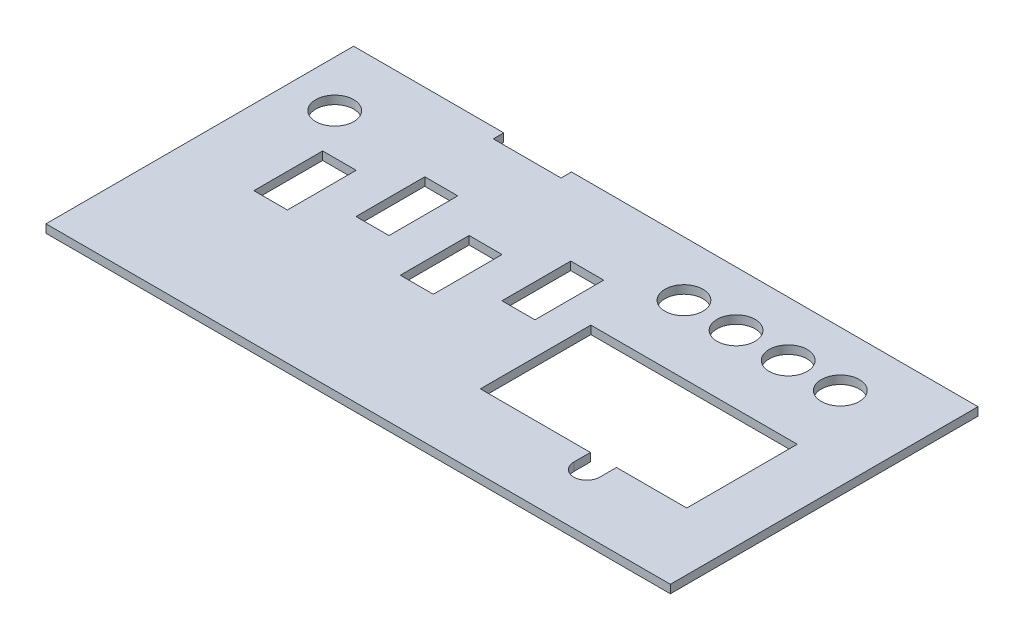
ISO-10303-21;
HEADER;
FILE_DESCRIPTION(('STEP AP214'),'2;1');
FILE_NAME('part.step','',(''),(''),'','','');
FILE_SCHEMA(('AUTOMOTIVE_DESIGN { 1 0 10303 214 1 1 1 1 }'));
ENDSEC;
DATA;
#1=APPLICATION_CONTEXT('core data for automotive mechanical design processes');
#2=APPLICATION_PROTOCOL_DEFINITION('international standard','automotive_design',2000,#1);
#3=PRODUCT_CONTEXT('',#1,'mechanical');
#4=PRODUCT('Part','Part','',(#3));
#5=PRODUCT_RELATED_PRODUCT_CATEGORY('part','',(#4));
#6=PRODUCT_DEFINITION_FORMATION('','',#4);
#7=PRODUCT_DEFINITION_CONTEXT('part definition',#1,'design');
#8=PRODUCT_DEFINITION('design','',#6,#7);
#9=PRODUCT_DEFINITION_SHAPE('','',#8);
#10=(LENGTH_UNIT() NAMED_UNIT(*) SI_UNIT(.MILLI.,.METRE.));
#11=(NAMED_UNIT(*) PLANE_ANGLE_UNIT() SI_UNIT($,.RADIAN.));
#12=(NAMED_UNIT(*) SI_UNIT($,.STERADIAN.) SOLID_ANGLE_UNIT());
#13=UNCERTAINTY_MEASURE_WITH_UNIT(LENGTH_MEASURE(1.E-05),#10,'distance_accuracy_value','');
#14=(GEOMETRIC_REPRESENTATION_CONTEXT(3) GLOBAL_UNCERTAINTY_ASSIGNED_CONTEXT((#13)) GLOBAL_UNIT_ASSIGNED_CONTEXT((#10,
#11,#12)) REPRESENTATION_CONTEXT('',''));
#15=CARTESIAN_POINT('',(0.,0.,0.));
#16=DIRECTION('',(0.,0.,1.));
#17=DIRECTION('',(1.,0.,0.));
#18=AXIS2_PLACEMENT_3D('',#15,#16,#17);
#19=CARTESIAN_POINT('',(48.8,0.,14.76));
#20=DIRECTION('',(0.,0.,1.));
#21=DIRECTION('',(1.,0.,0.));
#22=AXIS2_PLACEMENT_3D('',#19,#20,#21);
#23=PLANE('',#22);
#24=DIRECTION('',(1.,0.,0.));
#25=VECTOR('',#24,1.);
#26=CARTESIAN_POINT('',(48.8,0.,14.76));
#27=LINE('',#26,#25);
#28=CARTESIAN_POINT('',(35.32,0.,14.76));
#29=VERTEX_POINT('',#28);
#30=CARTESIAN_POINT('',(48.8,0.,14.76));
#31=VERTEX_POINT('',#30);
#32=EDGE_CURVE('E449',#29,#31,#27,.T.);
#33=ORIENTED_EDGE('',*,*,#32,.F.);
#34=DIRECTION('',(0.,-1.,0.));
#35=VECTOR('',#34,1.);
#36=CARTESIAN_POINT('',(35.32,1.5875,14.76));
#37=LINE('',#36,#35);
#38=CARTESIAN_POINT('',(35.32,1.5875,14.76));
#39=VERTEX_POINT('',#38);
#40=EDGE_CURVE('E277',#39,#29,#37,.T.);
#41=ORIENTED_EDGE('',*,*,#40,.F.);
#42=DIRECTION('',(1.,0.,0.));
#43=VECTOR('',#42,1.);
#44=CARTESIAN_POINT('',(48.8,1.5875,14.76));
#45=LINE('',#44,#43);
#46=CARTESIAN_POINT('',(48.8,1.5875,14.76));
#47=VERTEX_POINT('',#46);
#48=EDGE_CURVE('E269',#39,#47,#45,.T.);
#49=ORIENTED_EDGE('',*,*,#48,.T.);
#50=DIRECTION('',(0.,1.,0.));
#51=VECTOR('',#50,1.);
#52=CARTESIAN_POINT('',(48.8,0.,14.76));
#53=LINE('',#52,#51);
#54=EDGE_CURVE('E463',#31,#47,#53,.T.);
#55=ORIENTED_EDGE('',*,*,#54,.F.);
#56=EDGE_LOOP('',(#33,#41,#49,#55));
#57=FACE_BOUND('',#56,.T.);
#58=ADVANCED_FACE('F36',(#57),#23,.F.);
#59=CARTESIAN_POINT('',(0.,0.,0.));
#60=DIRECTION('',(0.,-1.,0.));
#61=DIRECTION('',(0.,0.,-1.));
#62=AXIS2_PLACEMENT_3D('',#59,#60,#61);
#63=PLANE('',#62);
#64=DIRECTION('',(0.,0.,1.));
#65=VECTOR('',#64,1.);
#66=CARTESIAN_POINT('',(35.32,0.,17.96));
#67=LINE('',#66,#65);
#68=CARTESIAN_POINT('',(35.32,0.,17.96));
#69=VERTEX_POINT('',#68);
#70=EDGE_CURVE('E251',#29,#69,#67,.T.);
#71=ORIENTED_EDGE('',*,*,#70,.F.);
#72=ORIENTED_EDGE('',*,*,#32,.T.);
#73=DIRECTION('',(0.,0.,-1.));
#74=VECTOR('',#73,1.);
#75=CARTESIAN_POINT('',(48.8,0.,14.76));
#76=LINE('',#75,#74);
#77=CARTESIAN_POINT('',(48.8,0.,-6.43999999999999));
#78=VERTEX_POINT('',#77);
#79=EDGE_CURVE('E439',#31,#78,#76,.T.);
#80=ORIENTED_EDGE('',*,*,#79,.T.);
#81=DIRECTION('',(-1.,0.,0.));
#82=VECTOR('',#81,1.);
#83=CARTESIAN_POINT('',(48.8,0.,-6.43999999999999));
#84=LINE('',#83,#82);
#85=CARTESIAN_POINT('',(9.19999999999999,0.,-6.43999999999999));
#86=VERTEX_POINT('',#85);
#87=EDGE_CURVE('E442',#78,#86,#84,.T.);
#88=ORIENTED_EDGE('',*,*,#87,.T.);
#89=DIRECTION('',(0.,0.,1.));
#90=VECTOR('',#89,1.);
#91=CARTESIAN_POINT('',(9.19999999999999,0.,-6.43999999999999));
#92=LINE('',#91,#90);
#93=CARTESIAN_POINT('',(9.19999999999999,0.,14.76));
#94=VERTEX_POINT('',#93);
#95=EDGE_CURVE('E446',#86,#94,#92,.T.);
#96=ORIENTED_EDGE('',*,*,#95,.T.);
#97=CARTESIAN_POINT('',(30.32,0.,14.76));
#98=VERTEX_POINT('',#97);
#99=EDGE_CURVE('E450',#94,#98,#27,.T.);
#100=ORIENTED_EDGE('',*,*,#99,.T.);
#101=DIRECTION('',(0.,0.,-1.));
#102=VECTOR('',#101,1.);
#103=CARTESIAN_POINT('',(30.32,0.,14.76));
#104=LINE('',#103,#102);
#105=CARTESIAN_POINT('',(30.32,0.,17.96));
#106=VERTEX_POINT('',#105);
#107=EDGE_CURVE('E51',#106,#98,#104,.T.);
#108=ORIENTED_EDGE('',*,*,#107,.F.);
#109=CARTESIAN_POINT('',(32.82,0.,17.96));
#110=DIRECTION('',(0.,-1.,0.));
#111=DIRECTION('',(0.,0.,-1.));
#112=AXIS2_PLACEMENT_3D('',#109,#110,#111);
#113=CIRCLE('',#112,2.5);
#114=EDGE_CURVE('E271',#69,#106,#113,.T.);
#115=ORIENTED_EDGE('',*,*,#114,.F.);
#116=EDGE_LOOP('',(#71,#72,#80,#88,#96,#100,#108,#115));
#117=FACE_BOUND('',#116,.T.);
#118=CARTESIAN_POINT('',(14.,0.,-19.5));
#119=DIRECTION('',(0.,1.,0.));
#120=DIRECTION('',(0.,0.,1.));
#121=AXIS2_PLACEMENT_3D('',#118,#119,#120);
#122=CIRCLE('',#121,3.65000000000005);
#123=CARTESIAN_POINT('',(14.,0.,-15.85));
#124=VERTEX_POINT('',#123);
#125=EDGE_CURVE('E353',#124,#124,#122,.T.);
#126=ORIENTED_EDGE('',*,*,#125,.T.);
#127=EDGE_LOOP('',(#126));
#128=FACE_BOUND('',#127,.T.);
#129=CARTESIAN_POINT('',(34.,0.,-19.5));
#130=DIRECTION('',(0.,1.,0.));
#131=DIRECTION('',(0.,0.,1.));
#132=AXIS2_PLACEMENT_3D('',#129,#130,#131);
#133=CIRCLE('',#132,3.65000000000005);
#134=CARTESIAN_POINT('',(34.,0.,-15.85));
#135=VERTEX_POINT('',#134);
#136=EDGE_CURVE('E360',#135,#135,#133,.T.);
#137=ORIENTED_EDGE('',*,*,#136,.T.);
#138=EDGE_LOOP('',(#137));
#139=FACE_BOUND('',#138,.T.);
#140=CARTESIAN_POINT('',(44.,0.,-19.5));
#141=DIRECTION('',(0.,1.,0.));
#142=DIRECTION('',(0.,0.,1.));
#143=AXIS2_PLACEMENT_3D('',#140,#141,#142);
#144=CIRCLE('',#143,3.65000000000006);
#145=CARTESIAN_POINT('',(44.,0.,-15.8499999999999));
#146=VERTEX_POINT('',#145);
#147=EDGE_CURVE('E366',#146,#146,#144,.T.);
#148=ORIENTED_EDGE('',*,*,#147,.T.);
#149=EDGE_LOOP('',(#148));
#150=FACE_BOUND('',#149,.T.);
#151=CARTESIAN_POINT('',(-51.,0.,-17.5000000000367));
#152=DIRECTION('',(0.,1.,0.));
#153=DIRECTION('',(0.,0.,1.));
#154=AXIS2_PLACEMENT_3D('',#151,#152,#153);
#155=CIRCLE('',#154,3.65000000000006);
#156=CARTESIAN_POINT('',(-51.,0.,-13.8500000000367));
#157=VERTEX_POINT('',#156);
#158=EDGE_CURVE('E372',#157,#157,#155,.T.);
#159=ORIENTED_EDGE('',*,*,#158,.T.);
#160=EDGE_LOOP('',(#159));
#161=FACE_BOUND('',#160,.T.);
#162=DIRECTION('',(-1.,0.,0.));
#163=VECTOR('',#162,1.);
#164=CARTESIAN_POINT('',(2.96550000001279,0.,-15.1431105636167));
#165=LINE('',#164,#163);
#166=CARTESIAN_POINT('',(2.96550000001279,0.,-15.1431105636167));
#167=VERTEX_POINT('',#166);
#168=CARTESIAN_POINT('',(-3.36550000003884,0.,-15.1431105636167));
#169=VERTEX_POINT('',#168);
#170=EDGE_CURVE('E379',#167,#169,#165,.T.);
#171=ORIENTED_EDGE('',*,*,#170,.T.);
#172=DIRECTION('',(2.82327588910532E-12,0.,1.));
#173=VECTOR('',#172,1.);
#174=CARTESIAN_POINT('',(-3.36550000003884,0.,-15.1431105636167));
#175=LINE('',#174,#173);
#176=CARTESIAN_POINT('',(-3.36550000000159,0.,-1.94655276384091));
#177=VERTEX_POINT('',#176);
#178=EDGE_CURVE('E382',#169,#177,#175,.T.);
#179=ORIENTED_EDGE('',*,*,#178,.T.);
#180=DIRECTION('',(1.,0.,0.));
#181=VECTOR('',#180,1.);
#182=CARTESIAN_POINT('',(-3.36550000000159,0.,-1.94655276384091));
#183=LINE('',#182,#181);
#184=CARTESIAN_POINT('',(2.96550000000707,0.,-1.94655276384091));
#185=VERTEX_POINT('',#184);
#186=EDGE_CURVE('E59',#177,#185,#183,.T.);
#187=ORIENTED_EDGE('',*,*,#186,.T.);
#188=DIRECTION('',(4.33301042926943E-13,0.,-1.));
#189=VECTOR('',#188,1.);
#190=CARTESIAN_POINT('',(2.96550000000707,0.,-1.94655276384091));
#191=LINE('',#190,#189);
#192=EDGE_CURVE('E387',#185,#167,#191,.T.);
#193=ORIENTED_EDGE('',*,*,#192,.T.);
#194=EDGE_LOOP('',(#171,#179,#187,#193));
#195=FACE_BOUND('',#194,.T.);
#196=DIRECTION('',(-1.,0.,0.));
#197=VECTOR('',#196,1.);
#198=CARTESIAN_POINT('',(-11.0344999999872,0.,-9.64311056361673));
#199=LINE('',#198,#197);
#200=CARTESIAN_POINT('',(-11.0344999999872,0.,-9.64311056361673));
#201=VERTEX_POINT('',#200);
#202=CARTESIAN_POINT('',(-17.3655000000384,0.,-9.64311056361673));
#203=VERTEX_POINT('',#202);
#204=EDGE_CURVE('E409',#201,#203,#199,.T.);
#205=ORIENTED_EDGE('',*,*,#204,.T.);
#206=DIRECTION('',(3.37465434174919E-12,0.,1.));
#207=VECTOR('',#206,1.);
#208=CARTESIAN_POINT('',(-17.3655000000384,0.,-9.64311056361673));
#209=LINE('',#208,#207);
#210=CARTESIAN_POINT('',(-17.3654999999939,0.,3.55344723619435));
#211=VERTEX_POINT('',#210);
#212=EDGE_CURVE('E412',#203,#211,#209,.T.);
#213=ORIENTED_EDGE('',*,*,#212,.T.);
#214=DIRECTION('',(1.,0.,-5.01524421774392E-12));
#215=VECTOR('',#214,1.);
#216=CARTESIAN_POINT('',(-17.3654999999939,0.,3.55344723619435));
#217=LINE('',#216,#215);
#218=CARTESIAN_POINT('',(-11.0344999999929,0.,3.5534472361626));
#219=VERTEX_POINT('',#218);
#220=EDGE_CURVE('E416',#211,#219,#217,.T.);
#221=ORIENTED_EDGE('',*,*,#220,.T.);
#222=DIRECTION('',(4.33399632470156E-13,0.,-1.));
#223=VECTOR('',#222,1.);
#224=CARTESIAN_POINT('',(-11.0344999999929,0.,3.5534472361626));
#225=LINE('',#224,#223);
#226=EDGE_CURVE('E419',#219,#201,#225,.T.);
#227=ORIENTED_EDGE('',*,*,#226,.T.);
#228=EDGE_LOOP('',(#205,#213,#221,#227));
#229=FACE_BOUND('',#228,.T.);
#230=DIRECTION('',(2.82255289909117E-12,0.,1.));
#231=VECTOR('',#230,1.);
#232=CARTESIAN_POINT('',(-31.3655000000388,0.,-15.1431105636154));
#233=LINE('',#232,#231);
#234=CARTESIAN_POINT('',(-31.3655000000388,0.,-15.1431105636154));
#235=VERTEX_POINT('',#234);
#236=CARTESIAN_POINT('',(-31.3655000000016,0.,-1.94655276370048));
#237=VERTEX_POINT('',#236);
#238=EDGE_CURVE('E283',#235,#237,#233,.T.);
#239=ORIENTED_EDGE('',*,*,#238,.T.);
#240=DIRECTION('',(1.,0.,0.));
#241=VECTOR('',#240,1.);
#242=CARTESIAN_POINT('',(-31.3655000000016,0.,-1.94655276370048));
#243=LINE('',#242,#241);
#244=CARTESIAN_POINT('',(-25.0344999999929,0.,-1.94655276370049));
#245=VERTEX_POINT('',#244);
#246=EDGE_CURVE('E286',#237,#245,#243,.T.);
#247=ORIENTED_EDGE('',*,*,#246,.T.);
#248=DIRECTION('',(4.33268179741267E-13,0.,-1.));
#249=VECTOR('',#248,1.);
#250=CARTESIAN_POINT('',(-25.0344999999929,0.,-1.94655276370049));
#251=LINE('',#250,#249);
#252=CARTESIAN_POINT('',(-25.0344999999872,0.,-15.1431105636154));
#253=VERTEX_POINT('',#252);
#254=EDGE_CURVE('E290',#245,#253,#251,.T.);
#255=ORIENTED_EDGE('',*,*,#254,.T.);
#256=DIRECTION('',(-1.,0.,0.));
#257=VECTOR('',#256,1.);
#258=CARTESIAN_POINT('',(-25.0344999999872,0.,-15.1431105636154));
#259=LINE('',#258,#257);
#260=EDGE_CURVE('E293',#253,#235,#259,.T.);
#261=ORIENTED_EDGE('',*,*,#260,.T.);
#262=EDGE_LOOP('',(#239,#247,#255,#261));
#263=FACE_BOUND('',#262,.T.);
#264=DIRECTION('',(0.,0.,1.));
#265=VECTOR('',#264,1.);
#266=CARTESIAN_POINT('',(-45.46,0.,-9.64311056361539));
#267=LINE('',#266,#265);
#268=CARTESIAN_POINT('',(-45.46,0.,-9.64311056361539));
#269=VERTEX_POINT('',#268);
#270=CARTESIAN_POINT('',(-45.46,0.,3.55344723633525));
#271=VERTEX_POINT('',#270);
#272=EDGE_CURVE('E317',#269,#271,#267,.T.);
#273=ORIENTED_EDGE('',*,*,#272,.T.);
#274=DIRECTION('',(1.,0.,-5.01505303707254E-12));
#275=VECTOR('',#274,1.);
#276=CARTESIAN_POINT('',(-45.46,0.,3.55344723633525));
#277=LINE('',#276,#275);
#278=CARTESIAN_POINT('',(-39.0344999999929,0.,3.55344723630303));
#279=VERTEX_POINT('',#278);
#280=EDGE_CURVE('E320',#271,#279,#277,.T.);
#281=ORIENTED_EDGE('',*,*,#280,.T.);
#282=DIRECTION('',(4.33268179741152E-13,0.,-1.));
#283=VECTOR('',#282,1.);
#284=CARTESIAN_POINT('',(-39.0344999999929,0.,3.55344723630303));
#285=LINE('',#284,#283);
#286=CARTESIAN_POINT('',(-39.0344999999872,0.,-9.64311056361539));
#287=VERTEX_POINT('',#286);
#288=EDGE_CURVE('E324',#279,#287,#285,.T.);
#289=ORIENTED_EDGE('',*,*,#288,.T.);
#290=DIRECTION('',(-1.,0.,0.));
#291=VECTOR('',#290,1.);
#292=CARTESIAN_POINT('',(-39.0344999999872,0.,-9.64311056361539));
#293=LINE('',#292,#291);
#294=EDGE_CURVE('E327',#287,#269,#293,.T.);
#295=ORIENTED_EDGE('',*,*,#294,.T.);
#296=EDGE_LOOP('',(#273,#281,#289,#295));
#297=FACE_BOUND('',#296,.T.);
#298=CARTESIAN_POINT('',(24.,0.,-19.5));
#299=DIRECTION('',(0.,1.,0.));
#300=DIRECTION('',(0.,0.,1.));
#301=AXIS2_PLACEMENT_3D('',#298,#299,#300);
#302=CIRCLE('',#301,3.65000000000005);
#303=CARTESIAN_POINT('',(24.,0.,-15.8499999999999));
#304=VERTEX_POINT('',#303);
#305=EDGE_CURVE('E334',#304,#304,#302,.T.);
#306=ORIENTED_EDGE('',*,*,#305,.T.);
#307=EDGE_LOOP('',(#306));
#308=FACE_BOUND('',#307,.T.);
#309=DIRECTION('',(0.,0.,1.));
#310=VECTOR('',#309,1.);
#311=CARTESIAN_POINT('',(-31.1,0.,-30.02));
#312=LINE('',#311,#310);
#313=CARTESIAN_POINT('',(-31.1,0.,-30.02));
#314=VERTEX_POINT('',#313);
#315=CARTESIAN_POINT('',(-31.1,0.,-28.02));
#316=VERTEX_POINT('',#315);
#317=EDGE_CURVE('E493',#314,#316,#312,.T.);
#318=ORIENTED_EDGE('',*,*,#317,.T.);
#319=DIRECTION('',(1.,0.,0.));
#320=VECTOR('',#319,1.);
#321=CARTESIAN_POINT('',(-31.1,0.,-28.02));
#322=LINE('',#321,#320);
#323=CARTESIAN_POINT('',(-18.1,0.,-28.02));
#324=VERTEX_POINT('',#323);
#325=EDGE_CURVE('E466',#316,#324,#322,.T.);
#326=ORIENTED_EDGE('',*,*,#325,.T.);
#327=DIRECTION('',(0.,0.,-1.));
#328=VECTOR('',#327,1.);
#329=CARTESIAN_POINT('',(-18.1,0.,-28.02));
#330=LINE('',#329,#328);
#331=CARTESIAN_POINT('',(-18.1,0.,-30.02));
#332=VERTEX_POINT('',#331);
#333=EDGE_CURVE('E475',#324,#332,#330,.T.);
#334=ORIENTED_EDGE('',*,*,#333,.T.);
#335=DIRECTION('',(1.,0.,0.));
#336=VECTOR('',#335,1.);
#337=CARTESIAN_POINT('',(-18.1,0.,-30.02));
#338=LINE('',#337,#336);
#339=CARTESIAN_POINT('',(59.895,0.,-30.02));
#340=VERTEX_POINT('',#339);
#341=EDGE_CURVE('E478',#332,#340,#338,.T.);
#342=ORIENTED_EDGE('',*,*,#341,.T.);
#343=DIRECTION('',(0.,0.,1.));
#344=VECTOR('',#343,1.);
#345=CARTESIAN_POINT('',(59.895,0.,-30.02));
#346=LINE('',#345,#344);
#347=CARTESIAN_POINT('',(59.895,0.,29.));
#348=VERTEX_POINT('',#347);
#349=EDGE_CURVE('E481',#340,#348,#346,.T.);
#350=ORIENTED_EDGE('',*,*,#349,.T.);
#351=DIRECTION('',(-1.,0.,0.));
#352=VECTOR('',#351,1.);
#353=CARTESIAN_POINT('',(59.895,0.,29.));
#354=LINE('',#353,#352);
#355=CARTESIAN_POINT('',(-59.895,0.,29.));
#356=VERTEX_POINT('',#355);
#357=EDGE_CURVE('E484',#348,#356,#354,.T.);
#358=ORIENTED_EDGE('',*,*,#357,.T.);
#359=DIRECTION('',(0.,0.,-1.));
#360=VECTOR('',#359,1.);
#361=CARTESIAN_POINT('',(-59.895,0.,29.));
#362=LINE('',#361,#360);
#363=CARTESIAN_POINT('',(-59.895,0.,-30.02));
#364=VERTEX_POINT('',#363);
#365=EDGE_CURVE('E487',#356,#364,#362,.T.);
#366=ORIENTED_EDGE('',*,*,#365,.T.);
#367=DIRECTION('',(1.,0.,0.));
#368=VECTOR('',#367,1.);
#369=CARTESIAN_POINT('',(-59.895,0.,-30.02));
#370=LINE('',#369,#368);
#371=EDGE_CURVE('E490',#364,#314,#370,.T.);
#372=ORIENTED_EDGE('',*,*,#371,.T.);
#373=EDGE_LOOP('',(#318,#326,#334,#342,#350,#358,#366,#372));
#374=FACE_BOUND('',#373,.T.);
#375=ADVANCED_FACE('F38',(#117,#128,#139,#150,#161,#195,#229,#263,#297,#308,#374),#63,.T.);
#376=CARTESIAN_POINT('',(-31.1,10.,-28.02));
#377=DIRECTION('',(0.,0.,-1.));
#378=DIRECTION('',(-1.,0.,0.));
#379=AXIS2_PLACEMENT_3D('',#376,#377,#378);
#380=PLANE('',#379);
#381=DIRECTION('',(1.,0.,0.));
#382=VECTOR('',#381,1.);
#383=CARTESIAN_POINT('',(0.,1.5875,-28.02));
#384=LINE('',#383,#382);
#385=CARTESIAN_POINT('',(-31.1,1.5875,-28.02));
#386=VERTEX_POINT('',#385);
#387=CARTESIAN_POINT('',(-18.1,1.5875,-28.02));
#388=VERTEX_POINT('',#387);
#389=EDGE_CURVE('E12',#386,#388,#384,.T.);
#390=ORIENTED_EDGE('',*,*,#389,.T.);
#391=DIRECTION('',(0.,-1.,0.));
#392=VECTOR('',#391,1.);
#393=CARTESIAN_POINT('',(-18.1,10.,-28.02));
#394=LINE('',#393,#392);
#395=EDGE_CURVE('E496',#388,#324,#394,.T.);
#396=ORIENTED_EDGE('',*,*,#395,.T.);
#397=ORIENTED_EDGE('',*,*,#325,.F.);
#398=DIRECTION('',(0.,-1.,0.));
#399=VECTOR('',#398,1.);
#400=CARTESIAN_POINT('',(-31.1,10.,-28.02));
#401=LINE('',#400,#399);
#402=EDGE_CURVE('E497',#386,#316,#401,.T.);
#403=ORIENTED_EDGE('',*,*,#402,.F.);
#404=EDGE_LOOP('',(#390,#396,#397,#403));
#405=FACE_BOUND('',#404,.T.);
#406=ADVANCED_FACE('F535',(#405),#380,.T.);
#407=CARTESIAN_POINT('',(-31.1,10.,-30.02));
#408=DIRECTION('',(1.,0.,0.));
#409=DIRECTION('',(0.,0.,-1.));
#410=AXIS2_PLACEMENT_3D('',#407,#408,#409);
#411=PLANE('',#410);
#412=DIRECTION('',(0.,0.,1.));
#413=VECTOR('',#412,1.);
#414=CARTESIAN_POINT('',(-31.1,1.5875,0.));
#415=LINE('',#414,#413);
#416=CARTESIAN_POINT('',(-31.1,1.5875,-30.02));
#417=VERTEX_POINT('',#416);
#418=EDGE_CURVE('E44',#417,#386,#415,.T.);
#419=ORIENTED_EDGE('',*,*,#418,.T.);
#420=ORIENTED_EDGE('',*,*,#402,.T.);
#421=ORIENTED_EDGE('',*,*,#317,.F.);
#422=DIRECTION('',(0.,-1.,0.));
#423=VECTOR('',#422,1.);
#424=CARTESIAN_POINT('',(-31.1,10.,-30.02));
#425=LINE('',#424,#423);
#426=EDGE_CURVE('E500',#417,#314,#425,.T.);
#427=ORIENTED_EDGE('',*,*,#426,.F.);
#428=EDGE_LOOP('',(#419,#420,#421,#427));
#429=FACE_BOUND('',#428,.T.);
#430=ADVANCED_FACE('F528',(#429),#411,.T.);
#431=CARTESIAN_POINT('',(-59.895,10.,-30.02));
#432=DIRECTION('',(0.,0.,-1.));
#433=DIRECTION('',(-1.,0.,0.));
#434=AXIS2_PLACEMENT_3D('',#431,#432,#433);
#435=PLANE('',#434);
#436=DIRECTION('',(1.,0.,0.));
#437=VECTOR('',#436,1.);
#438=CARTESIAN_POINT('',(0.,1.5875,-30.02));
#439=LINE('',#438,#437);
#440=CARTESIAN_POINT('',(-59.895,1.5875,-30.02));
#441=VERTEX_POINT('',#440);
#442=EDGE_CURVE('E523',#441,#417,#439,.T.);
#443=ORIENTED_EDGE('',*,*,#442,.T.);
#444=ORIENTED_EDGE('',*,*,#426,.T.);
#445=ORIENTED_EDGE('',*,*,#371,.F.);
#446=DIRECTION('',(0.,-1.,0.));
#447=VECTOR('',#446,1.);
#448=CARTESIAN_POINT('',(-59.895,10.,-30.02));
#449=LINE('',#448,#447);
#450=EDGE_CURVE('E502',#441,#364,#449,.T.);
#451=ORIENTED_EDGE('',*,*,#450,.F.);
#452=EDGE_LOOP('',(#443,#444,#445,#451));
#453=FACE_BOUND('',#452,.T.);
#454=ADVANCED_FACE('F552',(#453),#435,.T.);
#455=CARTESIAN_POINT('',(-59.895,10.,29.));
#456=DIRECTION('',(-1.,0.,0.));
#457=DIRECTION('',(0.,0.,1.));
#458=AXIS2_PLACEMENT_3D('',#455,#456,#457);
#459=PLANE('',#458);
#460=DIRECTION('',(0.,0.,-1.));
#461=VECTOR('',#460,1.);
#462=CARTESIAN_POINT('',(-59.895,1.5875,0.));
#463=LINE('',#462,#461);
#464=CARTESIAN_POINT('',(-59.895,1.5875,29.));
#465=VERTEX_POINT('',#464);
#466=EDGE_CURVE('E521',#465,#441,#463,.T.);
#467=ORIENTED_EDGE('',*,*,#466,.T.);
#468=ORIENTED_EDGE('',*,*,#450,.T.);
#469=ORIENTED_EDGE('',*,*,#365,.F.);
#470=DIRECTION('',(0.,-1.,0.));
#471=VECTOR('',#470,1.);
#472=CARTESIAN_POINT('',(-59.895,10.,29.));
#473=LINE('',#472,#471);
#474=EDGE_CURVE('E504',#465,#356,#473,.T.);
#475=ORIENTED_EDGE('',*,*,#474,.F.);
#476=EDGE_LOOP('',(#467,#468,#469,#475));
#477=FACE_BOUND('',#476,.T.);
#478=ADVANCED_FACE('F557',(#477),#459,.T.);
#479=CARTESIAN_POINT('',(59.895,10.,29.));
#480=DIRECTION('',(0.,0.,1.));
#481=DIRECTION('',(1.,0.,0.));
#482=AXIS2_PLACEMENT_3D('',#479,#480,#481);
#483=PLANE('',#482);
#484=DIRECTION('',(-1.,0.,0.));
#485=VECTOR('',#484,1.);
#486=CARTESIAN_POINT('',(0.,1.5875,29.));
#487=LINE('',#486,#485);
#488=CARTESIAN_POINT('',(59.895,1.5875,29.));
#489=VERTEX_POINT('',#488);
#490=EDGE_CURVE('E519',#489,#465,#487,.T.);
#491=ORIENTED_EDGE('',*,*,#490,.T.);
#492=ORIENTED_EDGE('',*,*,#474,.T.);
#493=ORIENTED_EDGE('',*,*,#357,.F.);
#494=DIRECTION('',(0.,-1.,0.));
#495=VECTOR('',#494,1.);
#496=CARTESIAN_POINT('',(59.895,10.,29.));
#497=LINE('',#496,#495);
#498=EDGE_CURVE('E506',#489,#348,#497,.T.);
#499=ORIENTED_EDGE('',*,*,#498,.F.);
#500=EDGE_LOOP('',(#491,#492,#493,#499));
#501=FACE_BOUND('',#500,.T.);
#502=ADVANCED_FACE('F560',(#501),#483,.T.);
#503=CARTESIAN_POINT('',(59.895,10.,-30.02));
#504=DIRECTION('',(1.,0.,0.));
#505=DIRECTION('',(0.,0.,-1.));
#506=AXIS2_PLACEMENT_3D('',#503,#504,#505);
#507=PLANE('',#506);
#508=DIRECTION('',(0.,0.,1.));
#509=VECTOR('',#508,1.);
#510=CARTESIAN_POINT('',(59.895,1.5875,0.));
#511=LINE('',#510,#509);
#512=CARTESIAN_POINT('',(59.895,1.5875,-30.02));
#513=VERTEX_POINT('',#512);
#514=EDGE_CURVE('E517',#513,#489,#511,.T.);
#515=ORIENTED_EDGE('',*,*,#514,.T.);
#516=ORIENTED_EDGE('',*,*,#498,.T.);
#517=ORIENTED_EDGE('',*,*,#349,.F.);
#518=DIRECTION('',(0.,-1.,0.));
#519=VECTOR('',#518,1.);
#520=CARTESIAN_POINT('',(59.895,10.,-30.02));
#521=LINE('',#520,#519);
#522=EDGE_CURVE('E508',#513,#340,#521,.T.);
#523=ORIENTED_EDGE('',*,*,#522,.F.);
#524=EDGE_LOOP('',(#515,#516,#517,#523));
#525=FACE_BOUND('',#524,.T.);
#526=ADVANCED_FACE('F563',(#525),#507,.T.);
#527=CARTESIAN_POINT('',(-18.1,10.,-30.02));
#528=DIRECTION('',(0.,0.,-1.));
#529=DIRECTION('',(-1.,0.,0.));
#530=AXIS2_PLACEMENT_3D('',#527,#528,#529);
#531=PLANE('',#530);
#532=DIRECTION('',(1.,0.,0.));
#533=VECTOR('',#532,1.);
#534=CARTESIAN_POINT('',(0.,1.5875,-30.02));
#535=LINE('',#534,#533);
#536=CARTESIAN_POINT('',(-18.1,1.5875,-30.02));
#537=VERTEX_POINT('',#536);
#538=EDGE_CURVE('E515',#537,#513,#535,.T.);
#539=ORIENTED_EDGE('',*,*,#538,.T.);
#540=ORIENTED_EDGE('',*,*,#522,.T.);
#541=ORIENTED_EDGE('',*,*,#341,.F.);
#542=DIRECTION('',(0.,-1.,0.));
#543=VECTOR('',#542,1.);
#544=CARTESIAN_POINT('',(-18.1,10.,-30.02));
#545=LINE('',#544,#543);
#546=EDGE_CURVE('E510',#537,#332,#545,.T.);
#547=ORIENTED_EDGE('',*,*,#546,.F.);
#548=EDGE_LOOP('',(#539,#540,#541,#547));
#549=FACE_BOUND('',#548,.T.);
#550=ADVANCED_FACE('F544',(#549),#531,.T.);
#551=CARTESIAN_POINT('',(-18.1,10.,-28.02));
#552=DIRECTION('',(-1.,0.,0.));
#553=DIRECTION('',(0.,0.,1.));
#554=AXIS2_PLACEMENT_3D('',#551,#552,#553);
#555=PLANE('',#554);
#556=DIRECTION('',(0.,0.,-1.));
#557=VECTOR('',#556,1.);
#558=CARTESIAN_POINT('',(-18.1,1.5875,0.));
#559=LINE('',#558,#557);
#560=EDGE_CURVE('E499',#388,#537,#559,.T.);
#561=ORIENTED_EDGE('',*,*,#560,.T.);
#562=ORIENTED_EDGE('',*,*,#546,.T.);
#563=ORIENTED_EDGE('',*,*,#333,.F.);
#564=ORIENTED_EDGE('',*,*,#395,.F.);
#565=EDGE_LOOP('',(#561,#562,#563,#564));
#566=FACE_BOUND('',#565,.T.);
#567=ADVANCED_FACE('F541',(#566),#555,.T.);
#568=CARTESIAN_POINT('',(0.,1.5875,0.));
#569=DIRECTION('',(0.,-1.,0.));
#570=DIRECTION('',(0.,0.,-1.));
#571=AXIS2_PLACEMENT_3D('',#568,#569,#570);
#572=PLANE('',#571);
#573=ORIENTED_EDGE('',*,*,#48,.F.);
#574=DIRECTION('',(0.,0.,1.));
#575=VECTOR('',#574,1.);
#576=CARTESIAN_POINT('',(35.32,1.5875,17.96));
#577=LINE('',#576,#575);
#578=CARTESIAN_POINT('',(35.32,1.5875,17.96));
#579=VERTEX_POINT('',#578);
#580=EDGE_CURVE('E248',#39,#579,#577,.T.);
#581=ORIENTED_EDGE('',*,*,#580,.T.);
#582=CARTESIAN_POINT('',(32.82,1.5875,17.96));
#583=DIRECTION('',(0.,-1.,0.));
#584=DIRECTION('',(0.,0.,-1.));
#585=AXIS2_PLACEMENT_3D('',#582,#583,#584);
#586=CIRCLE('',#585,2.5);
#587=CARTESIAN_POINT('',(30.32,1.5875,17.96));
#588=VERTEX_POINT('',#587);
#589=EDGE_CURVE('E259',#579,#588,#586,.T.);
#590=ORIENTED_EDGE('',*,*,#589,.T.);
#591=DIRECTION('',(0.,0.,-1.));
#592=VECTOR('',#591,1.);
#593=CARTESIAN_POINT('',(30.32,1.5875,14.76));
#594=LINE('',#593,#592);
#595=CARTESIAN_POINT('',(30.32,1.5875,14.76));
#596=VERTEX_POINT('',#595);
#597=EDGE_CURVE('E256',#588,#596,#594,.T.);
#598=ORIENTED_EDGE('',*,*,#597,.T.);
#599=CARTESIAN_POINT('',(9.19999999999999,1.5875,14.76));
#600=VERTEX_POINT('',#599);
#601=EDGE_CURVE('E443',#600,#596,#45,.T.);
#602=ORIENTED_EDGE('',*,*,#601,.F.);
#603=DIRECTION('',(0.,0.,1.));
#604=VECTOR('',#603,1.);
#605=CARTESIAN_POINT('',(9.19999999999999,1.5875,-6.43999999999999));
#606=LINE('',#605,#604);
#607=CARTESIAN_POINT('',(9.19999999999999,1.5875,-6.43999999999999));
#608=VERTEX_POINT('',#607);
#609=EDGE_CURVE('E458',#608,#600,#606,.T.);
#610=ORIENTED_EDGE('',*,*,#609,.F.);
#611=DIRECTION('',(-1.,0.,0.));
#612=VECTOR('',#611,1.);
#613=CARTESIAN_POINT('',(48.8,1.5875,-6.43999999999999));
#614=LINE('',#613,#612);
#615=CARTESIAN_POINT('',(48.8,1.5875,-6.43999999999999));
#616=VERTEX_POINT('',#615);
#617=EDGE_CURVE('E455',#616,#608,#614,.T.);
#618=ORIENTED_EDGE('',*,*,#617,.F.);
#619=DIRECTION('',(0.,0.,-1.));
#620=VECTOR('',#619,1.);
#621=CARTESIAN_POINT('',(48.8,1.5875,14.76));
#622=LINE('',#621,#620);
#623=EDGE_CURVE('E356',#47,#616,#622,.T.);
#624=ORIENTED_EDGE('',*,*,#623,.F.);
#625=EDGE_LOOP('',(#573,#581,#590,#598,#602,#610,#618,#624));
#626=FACE_BOUND('',#625,.T.);
#627=CARTESIAN_POINT('',(14.,1.5875,-19.5));
#628=DIRECTION('',(0.,1.,0.));
#629=DIRECTION('',(0.,0.,1.));
#630=AXIS2_PLACEMENT_3D('',#627,#628,#629);
#631=CIRCLE('',#630,3.65000000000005);
#632=CARTESIAN_POINT('',(14.,1.5875,-15.85));
#633=VERTEX_POINT('',#632);
#634=EDGE_CURVE('E357',#633,#633,#631,.T.);
#635=ORIENTED_EDGE('',*,*,#634,.F.);
#636=EDGE_LOOP('',(#635));
#637=FACE_BOUND('',#636,.T.);
#638=CARTESIAN_POINT('',(34.,1.5875,-19.5));
#639=DIRECTION('',(0.,1.,0.));
#640=DIRECTION('',(0.,0.,1.));
#641=AXIS2_PLACEMENT_3D('',#638,#639,#640);
#642=CIRCLE('',#641,3.65000000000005);
#643=CARTESIAN_POINT('',(34.,1.5875,-15.85));
#644=VERTEX_POINT('',#643);
#645=EDGE_CURVE('E363',#644,#644,#642,.T.);
#646=ORIENTED_EDGE('',*,*,#645,.F.);
#647=EDGE_LOOP('',(#646));
#648=FACE_BOUND('',#647,.T.);
#649=CARTESIAN_POINT('',(44.,1.5875,-19.5));
#650=DIRECTION('',(0.,1.,0.));
#651=DIRECTION('',(0.,0.,1.));
#652=AXIS2_PLACEMENT_3D('',#649,#650,#651);
#653=CIRCLE('',#652,3.65000000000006);
#654=CARTESIAN_POINT('',(44.,1.5875,-15.8499999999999));
#655=VERTEX_POINT('',#654);
#656=EDGE_CURVE('E369',#655,#655,#653,.T.);
#657=ORIENTED_EDGE('',*,*,#656,.F.);
#658=EDGE_LOOP('',(#657));
#659=FACE_BOUND('',#658,.T.);
#660=CARTESIAN_POINT('',(-51.,1.5875,-17.5000000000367));
#661=DIRECTION('',(0.,1.,0.));
#662=DIRECTION('',(0.,0.,1.));
#663=AXIS2_PLACEMENT_3D('',#660,#661,#662);
#664=CIRCLE('',#663,3.65000000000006);
#665=CARTESIAN_POINT('',(-51.,1.5875,-13.8500000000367));
#666=VERTEX_POINT('',#665);
#667=EDGE_CURVE('E375',#666,#666,#664,.T.);
#668=ORIENTED_EDGE('',*,*,#667,.F.);
#669=EDGE_LOOP('',(#668));
#670=FACE_BOUND('',#669,.T.);
#671=DIRECTION('',(2.82327588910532E-12,0.,1.));
#672=VECTOR('',#671,1.);
#673=CARTESIAN_POINT('',(-3.36550000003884,1.5875,-15.1431105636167));
#674=LINE('',#673,#672);
#675=CARTESIAN_POINT('',(-3.36550000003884,1.5875,-15.1431105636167));
#676=VERTEX_POINT('',#675);
#677=CARTESIAN_POINT('',(-3.36550000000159,1.5875,-1.94655276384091));
#678=VERTEX_POINT('',#677);
#679=EDGE_CURVE('E393',#676,#678,#674,.T.);
#680=ORIENTED_EDGE('',*,*,#679,.F.);
#681=DIRECTION('',(-1.,0.,0.));
#682=VECTOR('',#681,1.);
#683=CARTESIAN_POINT('',(2.96550000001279,1.5875,-15.1431105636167));
#684=LINE('',#683,#682);
#685=CARTESIAN_POINT('',(2.96550000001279,1.5875,-15.1431105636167));
#686=VERTEX_POINT('',#685);
#687=EDGE_CURVE('E391',#686,#676,#684,.T.);
#688=ORIENTED_EDGE('',*,*,#687,.F.);
#689=DIRECTION('',(4.33301042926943E-13,0.,-1.));
#690=VECTOR('',#689,1.);
#691=CARTESIAN_POINT('',(2.96550000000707,1.5875,-1.94655276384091));
#692=LINE('',#691,#690);
#693=CARTESIAN_POINT('',(2.96550000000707,1.5875,-1.94655276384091));
#694=VERTEX_POINT('',#693);
#695=EDGE_CURVE('E383',#694,#686,#692,.T.);
#696=ORIENTED_EDGE('',*,*,#695,.F.);
#697=DIRECTION('',(1.,0.,0.));
#698=VECTOR('',#697,1.);
#699=CARTESIAN_POINT('',(-3.36550000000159,1.5875,-1.94655276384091));
#700=LINE('',#699,#698);
#701=EDGE_CURVE('E397',#678,#694,#700,.T.);
#702=ORIENTED_EDGE('',*,*,#701,.F.);
#703=EDGE_LOOP('',(#680,#688,#696,#702));
#704=FACE_BOUND('',#703,.T.);
#705=DIRECTION('',(3.37465434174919E-12,0.,1.));
#706=VECTOR('',#705,1.);
#707=CARTESIAN_POINT('',(-17.3655000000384,1.5875,-9.64311056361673));
#708=LINE('',#707,#706);
#709=CARTESIAN_POINT('',(-17.3655000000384,1.5875,-9.64311056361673));
#710=VERTEX_POINT('',#709);
#711=CARTESIAN_POINT('',(-17.3654999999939,1.5875,3.55344723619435));
#712=VERTEX_POINT('',#711);
#713=EDGE_CURVE('E424',#710,#712,#708,.T.);
#714=ORIENTED_EDGE('',*,*,#713,.F.);
#715=DIRECTION('',(-1.,0.,0.));
#716=VECTOR('',#715,1.);
#717=CARTESIAN_POINT('',(-11.0344999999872,1.5875,-9.64311056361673));
#718=LINE('',#717,#716);
#719=CARTESIAN_POINT('',(-11.0344999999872,1.5875,-9.64311056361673));
#720=VERTEX_POINT('',#719);
#721=EDGE_CURVE('E310',#720,#710,#718,.T.);
#722=ORIENTED_EDGE('',*,*,#721,.F.);
#723=DIRECTION('',(4.33399632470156E-13,0.,-1.));
#724=VECTOR('',#723,1.);
#725=CARTESIAN_POINT('',(-11.0344999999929,1.5875,3.5534472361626));
#726=LINE('',#725,#724);
#727=CARTESIAN_POINT('',(-11.0344999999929,1.5875,3.5534472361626));
#728=VERTEX_POINT('',#727);
#729=EDGE_CURVE('E413',#728,#720,#726,.T.);
#730=ORIENTED_EDGE('',*,*,#729,.F.);
#731=DIRECTION('',(1.,0.,-5.01524421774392E-12));
#732=VECTOR('',#731,1.);
#733=CARTESIAN_POINT('',(-17.3654999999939,1.5875,3.55344723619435));
#734=LINE('',#733,#732);
#735=EDGE_CURVE('E427',#712,#728,#734,.T.);
#736=ORIENTED_EDGE('',*,*,#735,.F.);
#737=EDGE_LOOP('',(#714,#722,#730,#736));
#738=FACE_BOUND('',#737,.T.);
#739=DIRECTION('',(1.,0.,0.));
#740=VECTOR('',#739,1.);
#741=CARTESIAN_POINT('',(-31.3655000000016,1.5875,-1.94655276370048));
#742=LINE('',#741,#740);
#743=CARTESIAN_POINT('',(-31.3655000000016,1.5875,-1.94655276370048));
#744=VERTEX_POINT('',#743);
#745=CARTESIAN_POINT('',(-25.0344999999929,1.5875,-1.94655276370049));
#746=VERTEX_POINT('',#745);
#747=EDGE_CURVE('E299',#744,#746,#742,.T.);
#748=ORIENTED_EDGE('',*,*,#747,.F.);
#749=DIRECTION('',(2.82255289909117E-12,0.,1.));
#750=VECTOR('',#749,1.);
#751=CARTESIAN_POINT('',(-31.3655000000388,1.5875,-15.1431105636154));
#752=LINE('',#751,#750);
#753=CARTESIAN_POINT('',(-31.3655000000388,1.5875,-15.1431105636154));
#754=VERTEX_POINT('',#753);
#755=EDGE_CURVE('E297',#754,#744,#752,.T.);
#756=ORIENTED_EDGE('',*,*,#755,.F.);
#757=DIRECTION('',(-1.,0.,0.));
#758=VECTOR('',#757,1.);
#759=CARTESIAN_POINT('',(-25.0344999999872,1.5875,-15.1431105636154));
#760=LINE('',#759,#758);
#761=CARTESIAN_POINT('',(-25.0344999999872,1.5875,-15.1431105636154));
#762=VERTEX_POINT('',#761);
#763=EDGE_CURVE('E287',#762,#754,#760,.T.);
#764=ORIENTED_EDGE('',*,*,#763,.F.);
#765=DIRECTION('',(4.33268179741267E-13,0.,-1.));
#766=VECTOR('',#765,1.);
#767=CARTESIAN_POINT('',(-25.0344999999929,1.5875,-1.94655276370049));
#768=LINE('',#767,#766);
#769=EDGE_CURVE('E303',#746,#762,#768,.T.);
#770=ORIENTED_EDGE('',*,*,#769,.F.);
#771=EDGE_LOOP('',(#748,#756,#764,#770));
#772=FACE_BOUND('',#771,.T.);
#773=DIRECTION('',(1.,0.,-5.01505303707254E-12));
#774=VECTOR('',#773,1.);
#775=CARTESIAN_POINT('',(-45.46,1.5875,3.55344723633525));
#776=LINE('',#775,#774);
#777=CARTESIAN_POINT('',(-45.46,1.5875,3.55344723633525));
#778=VERTEX_POINT('',#777);
#779=CARTESIAN_POINT('',(-39.0344999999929,1.5875,3.55344723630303));
#780=VERTEX_POINT('',#779);
#781=EDGE_CURVE('E333',#778,#780,#776,.T.);
#782=ORIENTED_EDGE('',*,*,#781,.F.);
#783=DIRECTION('',(0.,0.,1.));
#784=VECTOR('',#783,1.);
#785=CARTESIAN_POINT('',(-45.46,1.5875,-9.64311056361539));
#786=LINE('',#785,#784);
#787=CARTESIAN_POINT('',(-45.46,1.5875,-9.64311056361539));
#788=VERTEX_POINT('',#787);
#789=EDGE_CURVE('E331',#788,#778,#786,.T.);
#790=ORIENTED_EDGE('',*,*,#789,.F.);
#791=DIRECTION('',(-1.,0.,0.));
#792=VECTOR('',#791,1.);
#793=CARTESIAN_POINT('',(-39.0344999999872,1.5875,-9.64311056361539));
#794=LINE('',#793,#792);
#795=CARTESIAN_POINT('',(-39.0344999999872,1.5875,-9.64311056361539));
#796=VERTEX_POINT('',#795);
#797=EDGE_CURVE('E321',#796,#788,#794,.T.);
#798=ORIENTED_EDGE('',*,*,#797,.F.);
#799=DIRECTION('',(4.33268179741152E-13,0.,-1.));
#800=VECTOR('',#799,1.);
#801=CARTESIAN_POINT('',(-39.0344999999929,1.5875,3.55344723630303));
#802=LINE('',#801,#800);
#803=EDGE_CURVE('E337',#780,#796,#802,.T.);
#804=ORIENTED_EDGE('',*,*,#803,.F.);
#805=EDGE_LOOP('',(#782,#790,#798,#804));
#806=FACE_BOUND('',#805,.T.);
#807=CARTESIAN_POINT('',(24.,1.5875,-19.5));
#808=DIRECTION('',(0.,1.,0.));
#809=DIRECTION('',(0.,0.,1.));
#810=AXIS2_PLACEMENT_3D('',#807,#808,#809);
#811=CIRCLE('',#810,3.65000000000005);
#812=CARTESIAN_POINT('',(24.,1.5875,-15.8499999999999));
#813=VERTEX_POINT('',#812);
#814=EDGE_CURVE('E279',#813,#813,#811,.T.);
#815=ORIENTED_EDGE('',*,*,#814,.F.);
#816=EDGE_LOOP('',(#815));
#817=FACE_BOUND('',#816,.T.);
#818=ORIENTED_EDGE('',*,*,#389,.F.);
#819=ORIENTED_EDGE('',*,*,#418,.F.);
#820=ORIENTED_EDGE('',*,*,#442,.F.);
#821=ORIENTED_EDGE('',*,*,#466,.F.);
#822=ORIENTED_EDGE('',*,*,#490,.F.);
#823=ORIENTED_EDGE('',*,*,#514,.F.);
#824=ORIENTED_EDGE('',*,*,#538,.F.);
#825=ORIENTED_EDGE('',*,*,#560,.F.);
#826=EDGE_LOOP('',(#818,#819,#820,#821,#822,#823,#824,#825));
#827=FACE_BOUND('',#826,.T.);
#828=ADVANCED_FACE('F266',(#626,#637,#648,#659,#670,#704,#738,#772,#806,#817,#827),#572,.F.);
#829=CARTESIAN_POINT('',(48.8,0.,14.76));
#830=DIRECTION('',(1.,0.,0.));
#831=DIRECTION('',(0.,0.,-1.));
#832=AXIS2_PLACEMENT_3D('',#829,#830,#831);
#833=PLANE('',#832);
#834=ORIENTED_EDGE('',*,*,#623,.T.);
#835=DIRECTION('',(0.,1.,0.));
#836=VECTOR('',#835,1.);
#837=CARTESIAN_POINT('',(48.8,0.,-6.43999999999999));
#838=LINE('',#837,#836);
#839=EDGE_CURVE('E453',#78,#616,#838,.T.);
#840=ORIENTED_EDGE('',*,*,#839,.F.);
#841=ORIENTED_EDGE('',*,*,#79,.F.);
#842=ORIENTED_EDGE('',*,*,#54,.T.);
#843=EDGE_LOOP('',(#834,#840,#841,#842));
#844=FACE_BOUND('',#843,.T.);
#845=ADVANCED_FACE('F587',(#844),#833,.F.);
#846=ORIENTED_EDGE('',*,*,#601,.T.);
#847=DIRECTION('',(0.,-1.,0.));
#848=VECTOR('',#847,1.);
#849=CARTESIAN_POINT('',(30.32,1.5875,14.76));
#850=LINE('',#849,#848);
#851=EDGE_CURVE('E280',#596,#98,#850,.T.);
#852=ORIENTED_EDGE('',*,*,#851,.T.);
#853=ORIENTED_EDGE('',*,*,#99,.F.);
#854=DIRECTION('',(0.,1.,0.));
#855=VECTOR('',#854,1.);
#856=CARTESIAN_POINT('',(9.19999999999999,0.,14.76));
#857=LINE('',#856,#855);
#858=EDGE_CURVE('E467',#94,#600,#857,.T.);
#859=ORIENTED_EDGE('',*,*,#858,.T.);
#860=EDGE_LOOP('',(#846,#852,#853,#859));
#861=FACE_BOUND('',#860,.T.);
#862=ADVANCED_FACE('F575',(#861),#23,.F.);
#863=CARTESIAN_POINT('',(9.19999999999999,0.,-6.43999999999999));
#864=DIRECTION('',(-1.,0.,0.));
#865=DIRECTION('',(0.,0.,1.));
#866=AXIS2_PLACEMENT_3D('',#863,#864,#865);
#867=PLANE('',#866);
#868=ORIENTED_EDGE('',*,*,#609,.T.);
#869=ORIENTED_EDGE('',*,*,#858,.F.);
#870=ORIENTED_EDGE('',*,*,#95,.F.);
#871=DIRECTION('',(0.,1.,0.));
#872=VECTOR('',#871,1.);
#873=CARTESIAN_POINT('',(9.19999999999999,0.,-6.43999999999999));
#874=LINE('',#873,#872);
#875=EDGE_CURVE('E469',#86,#608,#874,.T.);
#876=ORIENTED_EDGE('',*,*,#875,.T.);
#877=EDGE_LOOP('',(#868,#869,#870,#876));
#878=FACE_BOUND('',#877,.T.);
#879=ADVANCED_FACE('F586',(#878),#867,.F.);
#880=CARTESIAN_POINT('',(48.8,0.,-6.43999999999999));
#881=DIRECTION('',(0.,0.,-1.));
#882=DIRECTION('',(-1.,0.,0.));
#883=AXIS2_PLACEMENT_3D('',#880,#881,#882);
#884=PLANE('',#883);
#885=ORIENTED_EDGE('',*,*,#617,.T.);
#886=ORIENTED_EDGE('',*,*,#875,.F.);
#887=ORIENTED_EDGE('',*,*,#87,.F.);
#888=ORIENTED_EDGE('',*,*,#839,.T.);
#889=EDGE_LOOP('',(#885,#886,#887,#888));
#890=FACE_BOUND('',#889,.T.);
#891=ADVANCED_FACE('F593',(#890),#884,.F.);
#892=CARTESIAN_POINT('',(24.,0.,-19.5));
#893=DIRECTION('',(0.,1.,0.));
#894=DIRECTION('',(0.,0.,1.));
#895=AXIS2_PLACEMENT_3D('',#892,#893,#894);
#896=CYLINDRICAL_SURFACE('',#895,3.65000000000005);
#897=ORIENTED_EDGE('',*,*,#305,.F.);
#898=EDGE_LOOP('',(#897));
#899=FACE_BOUND('',#898,.T.);
#900=ORIENTED_EDGE('',*,*,#814,.T.);
#901=EDGE_LOOP('',(#900));
#902=FACE_BOUND('',#901,.T.);
#903=ADVANCED_FACE('F609',(#899,#902),#896,.F.);
#904=CARTESIAN_POINT('',(-45.46,0.,-9.64311056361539));
#905=DIRECTION('',(-1.,0.,0.));
#906=DIRECTION('',(0.,0.,1.));
#907=AXIS2_PLACEMENT_3D('',#904,#905,#906);
#908=PLANE('',#907);
#909=ORIENTED_EDGE('',*,*,#789,.T.);
#910=DIRECTION('',(0.,1.,0.));
#911=VECTOR('',#910,1.);
#912=CARTESIAN_POINT('',(-45.46,0.,3.55344723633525));
#913=LINE('',#912,#911);
#914=EDGE_CURVE('E330',#271,#778,#913,.T.);
#915=ORIENTED_EDGE('',*,*,#914,.F.);
#916=ORIENTED_EDGE('',*,*,#272,.F.);
#917=DIRECTION('',(0.,1.,0.));
#918=VECTOR('',#917,1.);
#919=CARTESIAN_POINT('',(-45.46,0.,-9.64311056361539));
#920=LINE('',#919,#918);
#921=EDGE_CURVE('E300',#269,#788,#920,.T.);
#922=ORIENTED_EDGE('',*,*,#921,.T.);
#923=EDGE_LOOP('',(#909,#915,#916,#922));
#924=FACE_BOUND('',#923,.T.);
#925=ADVANCED_FACE('F614',(#924),#908,.F.);
#926=CARTESIAN_POINT('',(-39.0344999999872,0.,-9.64311056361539));
#927=DIRECTION('',(0.,0.,-1.));
#928=DIRECTION('',(-1.,0.,0.));
#929=AXIS2_PLACEMENT_3D('',#926,#927,#928);
#930=PLANE('',#929);
#931=ORIENTED_EDGE('',*,*,#797,.T.);
#932=ORIENTED_EDGE('',*,*,#921,.F.);
#933=ORIENTED_EDGE('',*,*,#294,.F.);
#934=DIRECTION('',(0.,1.,0.));
#935=VECTOR('',#934,1.);
#936=CARTESIAN_POINT('',(-39.0344999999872,0.,-9.64311056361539));
#937=LINE('',#936,#935);
#938=EDGE_CURVE('E343',#287,#796,#937,.T.);
#939=ORIENTED_EDGE('',*,*,#938,.T.);
#940=EDGE_LOOP('',(#931,#932,#933,#939));
#941=FACE_BOUND('',#940,.T.);
#942=ADVANCED_FACE('F681',(#941),#930,.F.);
#943=CARTESIAN_POINT('',(-39.0344999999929,0.,3.55344723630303));
#944=DIRECTION('',(1.,0.,4.33268179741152E-13));
#945=DIRECTION('',(4.33268179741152E-13,0.,-1.));
#946=AXIS2_PLACEMENT_3D('',#943,#944,#945);
#947=PLANE('',#946);
#948=ORIENTED_EDGE('',*,*,#803,.T.);
#949=ORIENTED_EDGE('',*,*,#938,.F.);
#950=ORIENTED_EDGE('',*,*,#288,.F.);
#951=DIRECTION('',(0.,1.,0.));
#952=VECTOR('',#951,1.);
#953=CARTESIAN_POINT('',(-39.0344999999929,0.,3.55344723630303));
#954=LINE('',#953,#952);
#955=EDGE_CURVE('E345',#279,#780,#954,.T.);
#956=ORIENTED_EDGE('',*,*,#955,.T.);
#957=EDGE_LOOP('',(#948,#949,#950,#956));
#958=FACE_BOUND('',#957,.T.);
#959=ADVANCED_FACE('F691',(#958),#947,.F.);
#960=CARTESIAN_POINT('',(-45.46,0.,3.55344723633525));
#961=DIRECTION('',(5.01505303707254E-12,0.,1.));
#962=DIRECTION('',(1.,0.,-5.01505303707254E-12));
#963=AXIS2_PLACEMENT_3D('',#960,#961,#962);
#964=PLANE('',#963);
#965=ORIENTED_EDGE('',*,*,#781,.T.);
#966=ORIENTED_EDGE('',*,*,#955,.F.);
#967=ORIENTED_EDGE('',*,*,#280,.F.);
#968=ORIENTED_EDGE('',*,*,#914,.T.);
#969=EDGE_LOOP('',(#965,#966,#967,#968));
#970=FACE_BOUND('',#969,.T.);
#971=ADVANCED_FACE('F701',(#970),#964,.F.);
#972=CARTESIAN_POINT('',(-31.3655000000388,0.,-15.1431105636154));
#973=DIRECTION('',(-1.,0.,2.82255289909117E-12));
#974=DIRECTION('',(2.82255289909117E-12,0.,1.));
#975=AXIS2_PLACEMENT_3D('',#972,#973,#974);
#976=PLANE('',#975);
#977=ORIENTED_EDGE('',*,*,#755,.T.);
#978=DIRECTION('',(0.,1.,0.));
#979=VECTOR('',#978,1.);
#980=CARTESIAN_POINT('',(-31.3655000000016,0.,-1.94655276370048));
#981=LINE('',#980,#979);
#982=EDGE_CURVE('E296',#237,#744,#981,.T.);
#983=ORIENTED_EDGE('',*,*,#982,.F.);
#984=ORIENTED_EDGE('',*,*,#238,.F.);
#985=DIRECTION('',(0.,1.,0.));
#986=VECTOR('',#985,1.);
#987=CARTESIAN_POINT('',(-31.3655000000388,0.,-15.1431105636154));
#988=LINE('',#987,#986);
#989=EDGE_CURVE('E308',#235,#754,#988,.T.);
#990=ORIENTED_EDGE('',*,*,#989,.T.);
#991=EDGE_LOOP('',(#977,#983,#984,#990));
#992=FACE_BOUND('',#991,.T.);
#993=ADVANCED_FACE('F711',(#992),#976,.F.);
#994=CARTESIAN_POINT('',(-25.0344999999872,0.,-15.1431105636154));
#995=DIRECTION('',(0.,0.,-1.));
#996=DIRECTION('',(-1.,0.,0.));
#997=AXIS2_PLACEMENT_3D('',#994,#995,#996);
#998=PLANE('',#997);
#999=ORIENTED_EDGE('',*,*,#763,.T.);
#1000=ORIENTED_EDGE('',*,*,#989,.F.);
#1001=ORIENTED_EDGE('',*,*,#260,.F.);
#1002=DIRECTION('',(0.,1.,0.));
#1003=VECTOR('',#1002,1.);
#1004=CARTESIAN_POINT('',(-25.0344999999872,0.,-15.1431105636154));
#1005=LINE('',#1004,#1003);
#1006=EDGE_CURVE('E311',#253,#762,#1005,.T.);
#1007=ORIENTED_EDGE('',*,*,#1006,.T.);
#1008=EDGE_LOOP('',(#999,#1000,#1001,#1007));
#1009=FACE_BOUND('',#1008,.T.);
#1010=ADVANCED_FACE('F721',(#1009),#998,.F.);
#1011=CARTESIAN_POINT('',(-25.0344999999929,0.,-1.94655276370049));
#1012=DIRECTION('',(1.,0.,4.33268179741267E-13));
#1013=DIRECTION('',(4.33268179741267E-13,0.,-1.));
#1014=AXIS2_PLACEMENT_3D('',#1011,#1012,#1013);
#1015=PLANE('',#1014);
#1016=ORIENTED_EDGE('',*,*,#769,.T.);
#1017=ORIENTED_EDGE('',*,*,#1006,.F.);
#1018=ORIENTED_EDGE('',*,*,#254,.F.);
#1019=DIRECTION('',(0.,1.,0.));
#1020=VECTOR('',#1019,1.);
#1021=CARTESIAN_POINT('',(-25.0344999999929,0.,-1.94655276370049));
#1022=LINE('',#1021,#1020);
#1023=EDGE_CURVE('E313',#245,#746,#1022,.T.);
#1024=ORIENTED_EDGE('',*,*,#1023,.T.);
#1025=EDGE_LOOP('',(#1016,#1017,#1018,#1024));
#1026=FACE_BOUND('',#1025,.T.);
#1027=ADVANCED_FACE('F731',(#1026),#1015,.F.);
#1028=CARTESIAN_POINT('',(-31.3655000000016,0.,-1.94655276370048));
#1029=DIRECTION('',(0.,0.,1.));
#1030=DIRECTION('',(1.,0.,0.));
#1031=AXIS2_PLACEMENT_3D('',#1028,#1029,#1030);
#1032=PLANE('',#1031);
#1033=ORIENTED_EDGE('',*,*,#747,.T.);
#1034=ORIENTED_EDGE('',*,*,#1023,.F.);
#1035=ORIENTED_EDGE('',*,*,#246,.F.);
#1036=ORIENTED_EDGE('',*,*,#982,.T.);
#1037=EDGE_LOOP('',(#1033,#1034,#1035,#1036));
#1038=FACE_BOUND('',#1037,.T.);
#1039=ADVANCED_FACE('F741',(#1038),#1032,.F.);
#1040=CARTESIAN_POINT('',(-11.0344999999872,0.,-9.64311056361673));
#1041=DIRECTION('',(0.,0.,-1.));
#1042=DIRECTION('',(-1.,0.,0.));
#1043=AXIS2_PLACEMENT_3D('',#1040,#1041,#1042);
#1044=PLANE('',#1043);
#1045=ORIENTED_EDGE('',*,*,#721,.T.);
#1046=DIRECTION('',(0.,1.,0.));
#1047=VECTOR('',#1046,1.);
#1048=CARTESIAN_POINT('',(-17.3655000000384,0.,-9.64311056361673));
#1049=LINE('',#1048,#1047);
#1050=EDGE_CURVE('E422',#203,#710,#1049,.T.);
#1051=ORIENTED_EDGE('',*,*,#1050,.F.);
#1052=ORIENTED_EDGE('',*,*,#204,.F.);
#1053=DIRECTION('',(0.,1.,0.));
#1054=VECTOR('',#1053,1.);
#1055=CARTESIAN_POINT('',(-11.0344999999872,0.,-9.64311056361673));
#1056=LINE('',#1055,#1054);
#1057=EDGE_CURVE('E394',#201,#720,#1056,.T.);
#1058=ORIENTED_EDGE('',*,*,#1057,.T.);
#1059=EDGE_LOOP('',(#1045,#1051,#1052,#1058));
#1060=FACE_BOUND('',#1059,.T.);
#1061=ADVANCED_FACE('F751',(#1060),#1044,.F.);
#1062=CARTESIAN_POINT('',(-11.0344999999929,0.,3.5534472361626));
#1063=DIRECTION('',(1.,0.,4.33399632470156E-13));
#1064=DIRECTION('',(4.33399632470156E-13,0.,-1.));
#1065=AXIS2_PLACEMENT_3D('',#1062,#1063,#1064);
#1066=PLANE('',#1065);
#1067=ORIENTED_EDGE('',*,*,#729,.T.);
#1068=ORIENTED_EDGE('',*,*,#1057,.F.);
#1069=ORIENTED_EDGE('',*,*,#226,.F.);
#1070=DIRECTION('',(0.,1.,0.));
#1071=VECTOR('',#1070,1.);
#1072=CARTESIAN_POINT('',(-11.0344999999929,0.,3.5534472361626));
#1073=LINE('',#1072,#1071);
#1074=EDGE_CURVE('E433',#219,#728,#1073,.T.);
#1075=ORIENTED_EDGE('',*,*,#1074,.T.);
#1076=EDGE_LOOP('',(#1067,#1068,#1069,#1075));
#1077=FACE_BOUND('',#1076,.T.);
#1078=ADVANCED_FACE('F761',(#1077),#1066,.F.);
#1079=CARTESIAN_POINT('',(-17.3654999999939,0.,3.55344723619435));
#1080=DIRECTION('',(5.01524421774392E-12,0.,1.));
#1081=DIRECTION('',(1.,0.,-5.01524421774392E-12));
#1082=AXIS2_PLACEMENT_3D('',#1079,#1080,#1081);
#1083=PLANE('',#1082);
#1084=ORIENTED_EDGE('',*,*,#735,.T.);
#1085=ORIENTED_EDGE('',*,*,#1074,.F.);
#1086=ORIENTED_EDGE('',*,*,#220,.F.);
#1087=DIRECTION('',(0.,1.,0.));
#1088=VECTOR('',#1087,1.);
#1089=CARTESIAN_POINT('',(-17.3654999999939,0.,3.55344723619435));
#1090=LINE('',#1089,#1088);
#1091=EDGE_CURVE('E435',#211,#712,#1090,.T.);
#1092=ORIENTED_EDGE('',*,*,#1091,.T.);
#1093=EDGE_LOOP('',(#1084,#1085,#1086,#1092));
#1094=FACE_BOUND('',#1093,.T.);
#1095=ADVANCED_FACE('F770',(#1094),#1083,.F.);
#1096=CARTESIAN_POINT('',(-17.3655000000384,0.,-9.64311056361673));
#1097=DIRECTION('',(-1.,0.,3.37465434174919E-12));
#1098=DIRECTION('',(3.37465434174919E-12,0.,1.));
#1099=AXIS2_PLACEMENT_3D('',#1096,#1097,#1098);
#1100=PLANE('',#1099);
#1101=ORIENTED_EDGE('',*,*,#713,.T.);
#1102=ORIENTED_EDGE('',*,*,#1091,.F.);
#1103=ORIENTED_EDGE('',*,*,#212,.F.);
#1104=ORIENTED_EDGE('',*,*,#1050,.T.);
#1105=EDGE_LOOP('',(#1101,#1102,#1103,#1104));
#1106=FACE_BOUND('',#1105,.T.);
#1107=ADVANCED_FACE('F780',(#1106),#1100,.F.);
#1108=CARTESIAN_POINT('',(2.96550000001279,0.,-15.1431105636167));
#1109=DIRECTION('',(0.,0.,-1.));
#1110=DIRECTION('',(-1.,0.,0.));
#1111=AXIS2_PLACEMENT_3D('',#1108,#1109,#1110);
#1112=PLANE('',#1111);
#1113=ORIENTED_EDGE('',*,*,#687,.T.);
#1114=DIRECTION('',(0.,1.,0.));
#1115=VECTOR('',#1114,1.);
#1116=CARTESIAN_POINT('',(-3.36550000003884,0.,-15.1431105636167));
#1117=LINE('',#1116,#1115);
#1118=EDGE_CURVE('E390',#169,#676,#1117,.T.);
#1119=ORIENTED_EDGE('',*,*,#1118,.F.);
#1120=ORIENTED_EDGE('',*,*,#170,.F.);
#1121=DIRECTION('',(0.,1.,0.));
#1122=VECTOR('',#1121,1.);
#1123=CARTESIAN_POINT('',(2.96550000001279,0.,-15.1431105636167));
#1124=LINE('',#1123,#1122);
#1125=EDGE_CURVE('E378',#167,#686,#1124,.T.);
#1126=ORIENTED_EDGE('',*,*,#1125,.T.);
#1127=EDGE_LOOP('',(#1113,#1119,#1120,#1126));
#1128=FACE_BOUND('',#1127,.T.);
#1129=ADVANCED_FACE('F790',(#1128),#1112,.F.);
#1130=CARTESIAN_POINT('',(2.96550000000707,0.,-1.94655276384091));
#1131=DIRECTION('',(1.,0.,4.33301042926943E-13));
#1132=DIRECTION('',(4.33301042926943E-13,0.,-1.));
#1133=AXIS2_PLACEMENT_3D('',#1130,#1131,#1132);
#1134=PLANE('',#1133);
#1135=ORIENTED_EDGE('',*,*,#695,.T.);
#1136=ORIENTED_EDGE('',*,*,#1125,.F.);
#1137=ORIENTED_EDGE('',*,*,#192,.F.);
#1138=DIRECTION('',(0.,1.,0.));
#1139=VECTOR('',#1138,1.);
#1140=CARTESIAN_POINT('',(2.96550000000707,0.,-1.94655276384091));
#1141=LINE('',#1140,#1139);
#1142=EDGE_CURVE('E403',#185,#694,#1141,.T.);
#1143=ORIENTED_EDGE('',*,*,#1142,.T.);
#1144=EDGE_LOOP('',(#1135,#1136,#1137,#1143));
#1145=FACE_BOUND('',#1144,.T.);
#1146=ADVANCED_FACE('F800',(#1145),#1134,.F.);
#1147=CARTESIAN_POINT('',(-3.36550000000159,0.,-1.94655276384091));
#1148=DIRECTION('',(0.,0.,1.));
#1149=DIRECTION('',(1.,0.,0.));
#1150=AXIS2_PLACEMENT_3D('',#1147,#1148,#1149);
#1151=PLANE('',#1150);
#1152=ORIENTED_EDGE('',*,*,#701,.T.);
#1153=ORIENTED_EDGE('',*,*,#1142,.F.);
#1154=ORIENTED_EDGE('',*,*,#186,.F.);
#1155=DIRECTION('',(0.,1.,0.));
#1156=VECTOR('',#1155,1.);
#1157=CARTESIAN_POINT('',(-3.36550000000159,0.,-1.94655276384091));
#1158=LINE('',#1157,#1156);
#1159=EDGE_CURVE('E405',#177,#678,#1158,.T.);
#1160=ORIENTED_EDGE('',*,*,#1159,.T.);
#1161=EDGE_LOOP('',(#1152,#1153,#1154,#1160));
#1162=FACE_BOUND('',#1161,.T.);
#1163=ADVANCED_FACE('F810',(#1162),#1151,.F.);
#1164=CARTESIAN_POINT('',(-3.36550000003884,0.,-15.1431105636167));
#1165=DIRECTION('',(-1.,0.,2.82327588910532E-12));
#1166=DIRECTION('',(2.82327588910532E-12,0.,1.));
#1167=AXIS2_PLACEMENT_3D('',#1164,#1165,#1166);
#1168=PLANE('',#1167);
#1169=ORIENTED_EDGE('',*,*,#679,.T.);
#1170=ORIENTED_EDGE('',*,*,#1159,.F.);
#1171=ORIENTED_EDGE('',*,*,#178,.F.);
#1172=ORIENTED_EDGE('',*,*,#1118,.T.);
#1173=EDGE_LOOP('',(#1169,#1170,#1171,#1172));
#1174=FACE_BOUND('',#1173,.T.);
#1175=ADVANCED_FACE('F820',(#1174),#1168,.F.);
#1176=CARTESIAN_POINT('',(-51.,0.,-17.5000000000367));
#1177=DIRECTION('',(0.,1.,0.));
#1178=DIRECTION('',(0.,0.,1.));
#1179=AXIS2_PLACEMENT_3D('',#1176,#1177,#1178);
#1180=CYLINDRICAL_SURFACE('',#1179,3.65000000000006);
#1181=ORIENTED_EDGE('',*,*,#158,.F.);
#1182=EDGE_LOOP('',(#1181));
#1183=FACE_BOUND('',#1182,.T.);
#1184=ORIENTED_EDGE('',*,*,#667,.T.);
#1185=EDGE_LOOP('',(#1184));
#1186=FACE_BOUND('',#1185,.T.);
#1187=ADVANCED_FACE('F829',(#1183,#1186),#1180,.F.);
#1188=CARTESIAN_POINT('',(44.,0.,-19.5));
#1189=DIRECTION('',(0.,1.,0.));
#1190=DIRECTION('',(0.,0.,1.));
#1191=AXIS2_PLACEMENT_3D('',#1188,#1189,#1190);
#1192=CYLINDRICAL_SURFACE('',#1191,3.65000000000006);
#1193=ORIENTED_EDGE('',*,*,#147,.F.);
#1194=EDGE_LOOP('',(#1193));
#1195=FACE_BOUND('',#1194,.T.);
#1196=ORIENTED_EDGE('',*,*,#656,.T.);
#1197=EDGE_LOOP('',(#1196));
#1198=FACE_BOUND('',#1197,.T.);
#1199=ADVANCED_FACE('F839',(#1195,#1198),#1192,.F.);
#1200=CARTESIAN_POINT('',(34.,0.,-19.5));
#1201=DIRECTION('',(0.,1.,0.));
#1202=DIRECTION('',(0.,0.,1.));
#1203=AXIS2_PLACEMENT_3D('',#1200,#1201,#1202);
#1204=CYLINDRICAL_SURFACE('',#1203,3.65000000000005);
#1205=ORIENTED_EDGE('',*,*,#136,.F.);
#1206=EDGE_LOOP('',(#1205));
#1207=FACE_BOUND('',#1206,.T.);
#1208=ORIENTED_EDGE('',*,*,#645,.T.);
#1209=EDGE_LOOP('',(#1208));
#1210=FACE_BOUND('',#1209,.T.);
#1211=ADVANCED_FACE('F849',(#1207,#1210),#1204,.F.);
#1212=CARTESIAN_POINT('',(14.,0.,-19.5));
#1213=DIRECTION('',(0.,1.,0.));
#1214=DIRECTION('',(0.,0.,1.));
#1215=AXIS2_PLACEMENT_3D('',#1212,#1213,#1214);
#1216=CYLINDRICAL_SURFACE('',#1215,3.65000000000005);
#1217=ORIENTED_EDGE('',*,*,#125,.F.);
#1218=EDGE_LOOP('',(#1217));
#1219=FACE_BOUND('',#1218,.T.);
#1220=ORIENTED_EDGE('',*,*,#634,.T.);
#1221=EDGE_LOOP('',(#1220));
#1222=FACE_BOUND('',#1221,.T.);
#1223=ADVANCED_FACE('F859',(#1219,#1222),#1216,.F.);
#1224=CARTESIAN_POINT('',(35.32,1.5875,17.96));
#1225=DIRECTION('',(1.,0.,0.));
#1226=DIRECTION('',(0.,0.,-1.));
#1227=AXIS2_PLACEMENT_3D('',#1224,#1225,#1226);
#1228=PLANE('',#1227);
#1229=ORIENTED_EDGE('',*,*,#70,.T.);
#1230=DIRECTION('',(0.,-1.,0.));
#1231=VECTOR('',#1230,1.);
#1232=CARTESIAN_POINT('',(35.32,1.5875,17.96));
#1233=LINE('',#1232,#1231);
#1234=EDGE_CURVE('E244',#579,#69,#1233,.T.);
#1235=ORIENTED_EDGE('',*,*,#1234,.F.);
#1236=ORIENTED_EDGE('',*,*,#580,.F.);
#1237=ORIENTED_EDGE('',*,*,#40,.T.);
#1238=EDGE_LOOP('',(#1229,#1235,#1236,#1237));
#1239=FACE_BOUND('',#1238,.T.);
#1240=ADVANCED_FACE('F246',(#1239),#1228,.F.);
#1241=CARTESIAN_POINT('',(30.32,1.5875,14.76));
#1242=DIRECTION('',(-1.,0.,0.));
#1243=DIRECTION('',(0.,0.,1.));
#1244=AXIS2_PLACEMENT_3D('',#1241,#1242,#1243);
#1245=PLANE('',#1244);
#1246=ORIENTED_EDGE('',*,*,#107,.T.);
#1247=ORIENTED_EDGE('',*,*,#851,.F.);
#1248=ORIENTED_EDGE('',*,*,#597,.F.);
#1249=DIRECTION('',(0.,-1.,0.));
#1250=VECTOR('',#1249,1.);
#1251=CARTESIAN_POINT('',(30.32,1.5875,17.96));
#1252=LINE('',#1251,#1250);
#1253=EDGE_CURVE('E255',#588,#106,#1252,.T.);
#1254=ORIENTED_EDGE('',*,*,#1253,.T.);
#1255=EDGE_LOOP('',(#1246,#1247,#1248,#1254));
#1256=FACE_BOUND('',#1255,.T.);
#1257=ADVANCED_FACE('F601',(#1256),#1245,.F.);
#1258=CARTESIAN_POINT('',(32.82,1.5875,17.96));
#1259=DIRECTION('',(0.,-1.,0.));
#1260=DIRECTION('',(0.,0.,-1.));
#1261=AXIS2_PLACEMENT_3D('',#1258,#1259,#1260);
#1262=CYLINDRICAL_SURFACE('',#1261,2.5);
#1263=ORIENTED_EDGE('',*,*,#114,.T.);
#1264=ORIENTED_EDGE('',*,*,#1253,.F.);
#1265=ORIENTED_EDGE('',*,*,#589,.F.);
#1266=ORIENTED_EDGE('',*,*,#1234,.T.);
#1267=EDGE_LOOP('',(#1263,#1264,#1265,#1266));
#1268=FACE_BOUND('',#1267,.T.);
#1269=ADVANCED_FACE('F260',(#1268),#1262,.F.);
#1270=CLOSED_SHELL('',(#58,#375,#406,#430,#454,#478,#502,#526,#550,#567,#828,#845,#862,#879,
#891,#903,#925,#942,#959,#971,#993,#1010,#1027,#1039,#1061,#1078,#1095,#1107,#1129,#1146,#1163,
#1175,#1187,#1199,#1211,#1223,#1240,#1257,#1269));
#1271=MANIFOLD_SOLID_BREP('B2',#1270);
#1272=ADVANCED_BREP_SHAPE_REPRESENTATION('',(#18,#1271),#14);
#1273=SHAPE_DEFINITION_REPRESENTATION(#9,#1272);
ENDSEC;
END-ISO-10303-21;
